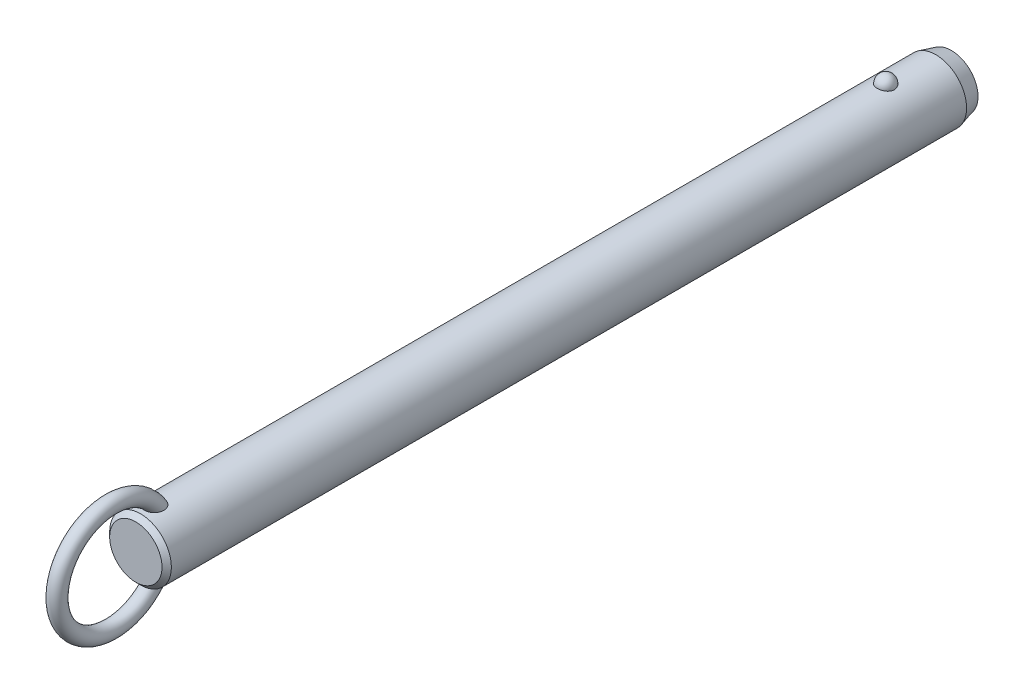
ISO-10303-21;
HEADER;
FILE_DESCRIPTION(('STEP AP214'),'2;1');
FILE_NAME('part.step','',(''),(''),'','','');
FILE_SCHEMA(('AUTOMOTIVE_DESIGN { 1 0 10303 214 1 1 1 1 }'));
ENDSEC;
DATA;
#1=APPLICATION_CONTEXT('core data for automotive mechanical design processes');
#2=APPLICATION_PROTOCOL_DEFINITION('international standard','automotive_design',2000,#1);
#3=PRODUCT_CONTEXT('',#1,'mechanical');
#4=PRODUCT('Part','Part','',(#3));
#5=PRODUCT_RELATED_PRODUCT_CATEGORY('part','',(#4));
#6=PRODUCT_DEFINITION_FORMATION('','',#4);
#7=PRODUCT_DEFINITION_CONTEXT('part definition',#1,'design');
#8=PRODUCT_DEFINITION('design','',#6,#7);
#9=PRODUCT_DEFINITION_SHAPE('','',#8);
#10=(LENGTH_UNIT() NAMED_UNIT(*) SI_UNIT(.MILLI.,.METRE.));
#11=(NAMED_UNIT(*) PLANE_ANGLE_UNIT() SI_UNIT($,.RADIAN.));
#12=(NAMED_UNIT(*) SI_UNIT($,.STERADIAN.) SOLID_ANGLE_UNIT());
#13=UNCERTAINTY_MEASURE_WITH_UNIT(LENGTH_MEASURE(1.E-05),#10,'distance_accuracy_value','');
#14=(GEOMETRIC_REPRESENTATION_CONTEXT(3) GLOBAL_UNCERTAINTY_ASSIGNED_CONTEXT((#13)) GLOBAL_UNIT_ASSIGNED_CONTEXT((#10,
#11,#12)) REPRESENTATION_CONTEXT('',''));
#15=CARTESIAN_POINT('',(0.,0.,0.));
#16=DIRECTION('',(0.,0.,1.));
#17=DIRECTION('',(1.,0.,0.));
#18=AXIS2_PLACEMENT_3D('',#15,#16,#17);
#19=CARTESIAN_POINT('',(0.,0.,180.3));
#20=DIRECTION('',(0.,0.,-1.));
#21=DIRECTION('',(-1.,0.,0.));
#22=AXIS2_PLACEMENT_3D('',#19,#20,#21);
#23=CYLINDRICAL_SURFACE('',#22,7.9);
#24=CARTESIAN_POINT('',(2.1785689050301,7.59367088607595,-2.20000000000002));
#25=CARTESIAN_POINT('',(2.17856679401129,7.59367269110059,-2.07701843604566));
#26=CARTESIAN_POINT('',(2.16853481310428,7.59657145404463,-1.95401006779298));
#27=CARTESIAN_POINT('',(2.12864689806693,7.607843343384,-1.71147811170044));
#28=CARTESIAN_POINT('',(2.09878338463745,7.61621856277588,-1.5919558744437));
#29=CARTESIAN_POINT('',(2.0199931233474,7.63749180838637,-1.35985638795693));
#30=CARTESIAN_POINT('',(1.97107475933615,7.6503878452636,-1.24727610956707));
#31=CARTESIAN_POINT('',(1.85539377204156,7.67926115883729,-1.03213234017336));
#32=CARTESIAN_POINT('',(1.78863158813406,7.69523835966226,-0.929568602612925));
#33=CARTESIAN_POINT('',(1.63856494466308,7.7285848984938,-0.73678633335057));
#34=CARTESIAN_POINT('',(1.55518140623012,7.7459606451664,-0.646630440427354));
#35=CARTESIAN_POINT('',(1.37422937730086,7.78009978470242,-0.481747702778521));
#36=CARTESIAN_POINT('',(1.27666086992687,7.79686317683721,-0.407020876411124));
#37=CARTESIAN_POINT('',(1.07024728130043,7.82786153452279,-0.275278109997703));
#38=CARTESIAN_POINT('',(0.961434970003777,7.84210353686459,-0.218212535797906));
#39=CARTESIAN_POINT('',(0.735351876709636,7.86652194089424,-0.123146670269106));
#40=CARTESIAN_POINT('',(0.618082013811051,7.87669878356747,-0.0851443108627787));
#41=CARTESIAN_POINT('',(0.380637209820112,7.89170521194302,-0.0298158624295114));
#42=CARTESIAN_POINT('',(0.260550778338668,7.89662650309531,-0.0121347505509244));
#43=CARTESIAN_POINT('',(0.0190117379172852,7.90090003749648,0.00324379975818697));
#44=CARTESIAN_POINT('',(-0.102440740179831,7.90025280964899,0.000943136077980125));
#45=CARTESIAN_POINT('',(-0.341452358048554,7.89351056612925,-0.0233955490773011));
#46=CARTESIAN_POINT('',(-0.459042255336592,7.88749257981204,-0.0451545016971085));
#47=CARTESIAN_POINT('',(-0.688796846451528,7.87075812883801,-0.107408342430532));
#48=CARTESIAN_POINT('',(-0.800961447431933,7.86004158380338,-0.14790355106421));
#49=CARTESIAN_POINT('',(-1.01743634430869,7.83497131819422,-0.246799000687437));
#50=CARTESIAN_POINT('',(-1.12169791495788,7.82059709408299,-0.305300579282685));
#51=CARTESIAN_POINT('',(-1.31891765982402,7.78976470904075,-0.43854939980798));
#52=CARTESIAN_POINT('',(-1.41187469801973,7.77330633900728,-0.513298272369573));
#53=CARTESIAN_POINT('',(-1.58577142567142,7.73972434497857,-0.678622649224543));
#54=CARTESIAN_POINT('',(-1.66645140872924,7.72259402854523,-0.769470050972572));
#55=CARTESIAN_POINT('',(-1.81161503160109,7.68983776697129,-0.963538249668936));
#56=CARTESIAN_POINT('',(-1.87609753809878,7.6742119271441,-1.0667599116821));
#57=CARTESIAN_POINT('',(-1.98790138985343,7.6460202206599,-1.28401170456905));
#58=CARTESIAN_POINT('',(-2.03501994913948,7.63349104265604,-1.39815107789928));
#59=CARTESIAN_POINT('',(-2.10986724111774,7.6131449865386,-1.6330178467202));
#60=CARTESIAN_POINT('',(-2.1375965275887,7.60532797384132,-1.75374505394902));
#61=CARTESIAN_POINT('',(-2.17289256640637,7.5953195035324,-1.99782562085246));
#62=CARTESIAN_POINT('',(-2.18054294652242,7.59310471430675,-2.12116592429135));
#63=CARTESIAN_POINT('',(-2.17572919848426,7.59448538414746,-2.36741799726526));
#64=CARTESIAN_POINT('',(-2.1632656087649,7.59808068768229,-2.49032977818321));
#65=CARTESIAN_POINT('',(-2.11865035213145,7.61064035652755,-2.73161015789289));
#66=CARTESIAN_POINT('',(-2.08659579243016,7.61957823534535,-2.84999812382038));
#67=CARTESIAN_POINT('',(-2.00367799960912,7.64179982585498,-3.07955956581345));
#68=CARTESIAN_POINT('',(-1.9528140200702,7.65508371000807,-3.19073275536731));
#69=CARTESIAN_POINT('',(-1.83321113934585,7.68460381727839,-3.40337899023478));
#70=CARTESIAN_POINT('',(-1.76437735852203,7.70085556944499,-3.5047965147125));
#71=CARTESIAN_POINT('',(-1.61069526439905,7.73445734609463,-3.69446912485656));
#72=CARTESIAN_POINT('',(-1.52584634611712,7.75180741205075,-3.78272371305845));
#73=CARTESIAN_POINT('',(-1.34198059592,7.78574608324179,-3.94393987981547));
#74=CARTESIAN_POINT('',(-1.24291308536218,7.80233167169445,-4.01684434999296));
#75=CARTESIAN_POINT('',(-1.03352039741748,7.83281625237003,-4.14489386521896));
#76=CARTESIAN_POINT('',(-0.92319600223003,7.84671543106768,-4.20004014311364));
#77=CARTESIAN_POINT('',(-0.695822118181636,7.87011575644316,-4.29042017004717));
#78=CARTESIAN_POINT('',(-0.578872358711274,7.87966903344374,-4.32589112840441));
#79=CARTESIAN_POINT('',(-0.340410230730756,7.8935652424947,-4.37692226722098));
#80=CARTESIAN_POINT('',(-0.218898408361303,7.89790879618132,-4.39248482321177));
#81=CARTESIAN_POINT('',(0.0228107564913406,7.90087453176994,-4.40314405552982));
#82=CARTESIAN_POINT('',(0.142990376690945,7.89960185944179,-4.39861683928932));
#83=CARTESIAN_POINT('',(0.380829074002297,7.89171262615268,-4.37008293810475));
#84=CARTESIAN_POINT('',(0.498488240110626,7.8850962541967,-4.34607694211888));
#85=CARTESIAN_POINT('',(0.727535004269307,7.86726442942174,-4.27939317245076));
#86=CARTESIAN_POINT('',(0.838944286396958,7.85606616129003,-4.23678512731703));
#87=CARTESIAN_POINT('',(1.05295421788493,7.83025654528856,-4.13408348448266));
#88=CARTESIAN_POINT('',(1.15555431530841,7.81564498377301,-4.07398879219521));
#89=CARTESIAN_POINT('',(1.35076763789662,7.7843022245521,-3.93687432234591));
#90=CARTESIAN_POINT('',(1.4432046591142,7.76754209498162,-3.85961036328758));
#91=CARTESIAN_POINT('',(1.6139111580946,7.73387857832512,-3.69076949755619));
#92=CARTESIAN_POINT('',(1.6921781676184,7.71697516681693,-3.59919010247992));
#93=CARTESIAN_POINT('',(1.83380875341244,7.6845643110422,-3.40247278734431));
#94=CARTESIAN_POINT('',(1.89689280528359,7.66908588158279,-3.29712873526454));
#95=CARTESIAN_POINT('',(2.0047823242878,7.64159441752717,-3.07707931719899));
#96=CARTESIAN_POINT('',(2.0495945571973,7.62958010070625,-2.96237743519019));
#97=CARTESIAN_POINT('',(2.11580183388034,7.61146617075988,-2.74040519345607));
#98=CARTESIAN_POINT('',(2.13929812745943,7.60484503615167,-2.63379846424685));
#99=CARTESIAN_POINT('',(2.17068242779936,7.59594664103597,-2.4181348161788));
#100=CARTESIAN_POINT('',(2.17857077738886,7.59366928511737,-2.30907795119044));
#101=CARTESIAN_POINT('',(2.1785689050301,7.59367088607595,-2.20000000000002));
#102=B_SPLINE_CURVE_WITH_KNOTS('',3,(#24,#25,#26,#27,#28,#29,#30,#31,#32,#33,#34,#35,#36,#37,
#38,#39,#40,#41,#42,#43,#44,#45,#46,#47,#48,#49,#50,#51,#52,#53,#54,#55,#56,#57,#58,#59,#60,#61,
#62,#63,#64,#65,#66,#67,#68,#69,#70,#71,#72,#73,#74,#75,#76,#77,#78,#79,#80,#81,#82,#83,#84,#85,
#86,#87,#88,#89,#90,#91,#92,#93,#94,#95,#96,#97,#98,#99,#100,#101),.UNSPECIFIED.,.T.,.F.,(4,2,2,
2,2,2,2,2,2,2,2,2,2,2,2,2,2,2,2,2,2,2,2,2,2,2,2,2,2,2,2,2,2,2,2,2,2,2,4),(0.,0.368552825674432,
0.737246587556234,1.10577831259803,1.4743009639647,1.8446206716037,2.21494081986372,
2.5842105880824,2.95344028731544,3.31611630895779,3.67875788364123,4.03628044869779,
4.39380913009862,4.75338791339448,5.11300280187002,5.47939989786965,5.8458226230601,
6.21639834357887,6.58696347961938,6.95598276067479,7.32499216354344,7.69218715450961,
8.0593967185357,8.42858578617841,8.79778880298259,9.16834203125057,9.5388695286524,
9.90482699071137,10.2707407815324,10.6298333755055,10.9889132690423,11.3466585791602,
11.7044262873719,12.0676511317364,12.4309391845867,12.8004764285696,13.1698767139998,
13.4967701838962,13.8236564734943),.UNSPECIFIED.);
#103=CARTESIAN_POINT('',(2.1785689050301,7.59367088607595,-2.20000000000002));
#104=VERTEX_POINT('',#103);
#105=EDGE_CURVE('E41',#104,#104,#102,.T.);
#106=ORIENTED_EDGE('',*,*,#105,.T.);
#107=EDGE_LOOP('',(#106));
#108=FACE_BOUND('',#107,.T.);
#109=CARTESIAN_POINT('',(0.,0.,188.62));
#110=DIRECTION('',(0.,0.,1.));
#111=DIRECTION('',(1.,0.,0.));
#112=AXIS2_PLACEMENT_3D('',#109,#110,#111);
#113=CIRCLE('',#112,7.9);
#114=CARTESIAN_POINT('',(7.9,0.,188.62));
#115=VERTEX_POINT('',#114);
#116=EDGE_CURVE('E10',#115,#115,#113,.F.);
#117=ORIENTED_EDGE('',*,*,#116,.T.);
#118=EDGE_LOOP('',(#117));
#119=FACE_BOUND('',#118,.T.);
#120=CARTESIAN_POINT('',(-0.630969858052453,-7.87476203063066,182.512432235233));
#121=CARTESIAN_POINT('',(-0.734180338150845,-7.86648998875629,182.547285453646));
#122=CARTESIAN_POINT('',(-0.834476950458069,-7.85639291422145,182.590816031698));
#123=CARTESIAN_POINT('',(-1.0262035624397,-7.83366343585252,182.694094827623));
#124=CARTESIAN_POINT('',(-1.1176141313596,-7.82102565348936,182.753877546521));
#125=CARTESIAN_POINT('',(-1.28877277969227,-7.79464922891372,182.887839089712));
#126=CARTESIAN_POINT('',(-1.36854014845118,-7.78091246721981,182.961993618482));
#127=CARTESIAN_POINT('',(-1.5146152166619,-7.75380398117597,183.122494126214));
#128=CARTESIAN_POINT('',(-1.58092966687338,-7.74043207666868,183.208833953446));
#129=CARTESIAN_POINT('',(-1.70019064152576,-7.7151252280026,183.392978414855));
#130=CARTESIAN_POINT('',(-1.75284037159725,-7.70322473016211,183.490979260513));
#131=CARTESIAN_POINT('',(-1.84263464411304,-7.68224112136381,183.694102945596));
#132=CARTESIAN_POINT('',(-1.87977299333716,-7.6731591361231,183.799228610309));
#133=CARTESIAN_POINT('',(-1.94152728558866,-7.65777930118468,184.023284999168));
#134=CARTESIAN_POINT('',(-1.96475471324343,-7.65179654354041,184.142616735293));
#135=CARTESIAN_POINT('',(-1.99449499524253,-7.64409642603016,184.38342986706));
#136=CARTESIAN_POINT('',(-2.0010005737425,-7.64238092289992,184.504912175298));
#137=CARTESIAN_POINT('',(-1.99856014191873,-7.64302120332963,184.768340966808));
#138=CARTESIAN_POINT('',(-1.98680021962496,-7.64611845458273,184.91025654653));
#139=CARTESIAN_POINT('',(-1.94457772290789,-7.65696186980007,185.191118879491));
#140=CARTESIAN_POINT('',(-1.91409393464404,-7.66471330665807,185.330062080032));
#141=CARTESIAN_POINT('',(-1.82768670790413,-7.68582947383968,185.631939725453));
#142=CARTESIAN_POINT('',(-1.76772963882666,-7.70003779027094,185.793686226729));
#143=CARTESIAN_POINT('',(-1.65998501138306,-7.72371550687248,186.027695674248));
#144=CARTESIAN_POINT('',(-1.62107967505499,-7.73200670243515,186.104297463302));
#145=CARTESIAN_POINT('',(-1.53727726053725,-7.7491037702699,186.254079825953));
#146=CARTESIAN_POINT('',(-1.49238215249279,-7.75790947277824,186.327261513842));
#147=CARTESIAN_POINT('',(-1.37397050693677,-7.77993338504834,186.50288382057));
#148=CARTESIAN_POINT('',(-1.29690364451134,-7.79328473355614,186.602955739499));
#149=CARTESIAN_POINT('',(-1.12885487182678,-7.81939266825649,186.790714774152));
#150=CARTESIAN_POINT('',(-1.03789926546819,-7.83215032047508,186.878424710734));
#151=CARTESIAN_POINT('',(-0.869532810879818,-7.85231710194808,187.013414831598));
#152=CARTESIAN_POINT('',(-0.795716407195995,-7.86021093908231,187.065076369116));
#153=CARTESIAN_POINT('',(-0.640813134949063,-7.87434920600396,187.156381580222));
#154=CARTESIAN_POINT('',(-0.559737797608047,-7.88059619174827,187.19604389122));
#155=CARTESIAN_POINT('',(-0.406456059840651,-7.88984116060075,187.254300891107));
#156=CARTESIAN_POINT('',(-0.335227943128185,-7.89321892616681,187.275384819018));
#157=CARTESIAN_POINT('',(-0.190193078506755,-7.89804235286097,187.30541418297));
#158=CARTESIAN_POINT('',(-0.116388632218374,-7.89948969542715,187.314370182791));
#159=CARTESIAN_POINT('',(0.0318414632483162,-7.90028409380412,187.319291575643));
#160=CARTESIAN_POINT('',(0.106268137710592,-7.89962640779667,187.315227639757));
#161=CARTESIAN_POINT('',(0.253290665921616,-7.8962818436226,187.294461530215));
#162=CARTESIAN_POINT('',(0.325885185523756,-7.8935935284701,187.277750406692));
#163=CARTESIAN_POINT('',(0.481441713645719,-7.88577340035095,187.228738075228));
#164=CARTESIAN_POINT('',(0.563611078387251,-7.88026321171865,187.194005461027));
#165=CARTESIAN_POINT('',(0.721129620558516,-7.86741729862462,187.111796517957));
#166=CARTESIAN_POINT('',(0.79646633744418,-7.86007832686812,187.064297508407));
#167=CARTESIAN_POINT('',(0.971456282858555,-7.84073285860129,186.936513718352));
#168=CARTESIAN_POINT('',(1.06719686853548,-7.82809461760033,186.851004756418));
#169=CARTESIAN_POINT('',(1.24418921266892,-7.80192439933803,186.666232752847));
#170=CARTESIAN_POINT('',(1.32540832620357,-7.78839049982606,186.566939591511));
#171=CARTESIAN_POINT('',(1.45199971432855,-7.76559693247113,186.389576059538));
#172=CARTESIAN_POINT('',(1.50085649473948,-7.75626094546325,186.313954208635));
#173=CARTESIAN_POINT('',(1.59197749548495,-7.7380727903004,186.158742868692));
#174=CARTESIAN_POINT('',(1.63423919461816,-7.72922080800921,186.079151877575));
#175=CARTESIAN_POINT('',(1.71222612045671,-7.71231959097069,185.916664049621));
#176=CARTESIAN_POINT('',(1.74794516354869,-7.70427111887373,185.833764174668));
#177=CARTESIAN_POINT('',(1.81270113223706,-7.68929240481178,185.665296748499));
#178=CARTESIAN_POINT('',(1.84173789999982,-7.68236218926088,185.579729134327));
#179=CARTESIAN_POINT('',(1.89322698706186,-7.6698375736,185.40528702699));
#180=CARTESIAN_POINT('',(1.91558744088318,-7.66426199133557,185.316383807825));
#181=CARTESIAN_POINT('',(1.95281367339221,-7.65485915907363,185.136969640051));
#182=CARTESIAN_POINT('',(1.96767946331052,-7.65103190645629,185.046458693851));
#183=CARTESIAN_POINT('',(2.0002145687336,-7.64262981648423,184.773732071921));
#184=CARTESIAN_POINT('',(2.00600691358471,-7.6410871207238,184.589709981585));
#185=CARTESIAN_POINT('',(1.98445334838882,-7.64669564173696,184.276501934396));
#186=CARTESIAN_POINT('',(1.96607186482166,-7.65149688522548,184.146618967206));
#187=CARTESIAN_POINT('',(1.90884967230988,-7.66597624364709,183.891632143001));
#188=CARTESIAN_POINT('',(1.87002101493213,-7.67565148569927,183.766525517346));
#189=CARTESIAN_POINT('',(1.77063986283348,-7.69918471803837,183.52454013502));
#190=CARTESIAN_POINT('',(1.70993724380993,-7.71307150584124,183.407725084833));
#191=CARTESIAN_POINT('',(1.56733070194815,-7.74330306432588,183.188144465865));
#192=CARTESIAN_POINT('',(1.48543692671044,-7.75964665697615,183.085372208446));
#193=CARTESIAN_POINT('',(1.31346177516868,-7.79047523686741,182.909380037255));
#194=CARTESIAN_POINT('',(1.22547278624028,-7.80495298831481,182.834106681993));
#195=CARTESIAN_POINT('',(1.03724352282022,-7.83218597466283,182.700486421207));
#196=CARTESIAN_POINT('',(0.93700840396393,-7.84494192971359,182.642132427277));
#197=CARTESIAN_POINT('',(0.733599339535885,-7.86649045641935,182.547027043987));
#198=CARTESIAN_POINT('',(0.630941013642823,-7.87547134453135,182.509210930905));
#199=CARTESIAN_POINT('',(0.420465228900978,-7.88950708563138,182.451116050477));
#200=CARTESIAN_POINT('',(0.312645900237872,-7.89456050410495,182.43084369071));
#201=CARTESIAN_POINT('',(0.096086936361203,-7.9001518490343,182.408455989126));
#202=CARTESIAN_POINT('',(-0.0126341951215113,-7.90073226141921,182.406169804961));
#203=CARTESIAN_POINT('',(-0.228766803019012,-7.89742350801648,182.419367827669));
#204=CARTESIAN_POINT('',(-0.336180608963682,-7.89354403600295,182.434813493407));
#205=CARTESIAN_POINT('',(-0.473410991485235,-7.88586871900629,182.466217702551));
#206=CARTESIAN_POINT('',(-0.50525779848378,-7.88388984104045,182.474354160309));
#207=CARTESIAN_POINT('',(-0.56848128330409,-7.87958326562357,182.492208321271));
#208=CARTESIAN_POINT('',(-0.59985795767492,-7.87725556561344,182.501926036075));
#209=CARTESIAN_POINT('',(-0.630969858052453,-7.87476203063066,182.512432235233));
#210=B_SPLINE_CURVE_WITH_KNOTS('',3,(#120,#121,#122,#123,#124,#125,#126,#127,#128,#129,#130,
#131,#132,#133,#134,#135,#136,#137,#138,#139,#140,#141,#142,#143,#144,#145,#146,#147,#148,#149,
#150,#151,#152,#153,#154,#155,#156,#157,#158,#159,#160,#161,#162,#163,#164,#165,#166,#167,#168,
#169,#170,#171,#172,#173,#174,#175,#176,#177,#178,#179,#180,#181,#182,#183,#184,#185,#186,#187,
#188,#189,#190,#191,#192,#193,#194,#195,#196,#197,#198,#199,#200,#201,#202,#203,#204,#205,#206,
#207,#208,#209),.UNSPECIFIED.,.T.,.F.,(4,2,2,2,2,2,2,2,2,2,2,2,2,2,2,2,2,2,2,2,2,2,2,2,2,2,2,2,
2,2,2,2,2,2,2,2,2,2,2,2,2,2,2,2,4),(0.,0.327622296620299,0.655945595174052,0.983718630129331,
1.31132677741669,1.6455465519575,1.97989964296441,2.34365728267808,2.70757317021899,
3.13333684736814,3.55958380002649,4.07655306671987,4.33527897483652,4.59391999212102,
4.97382437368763,5.353017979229,5.62348245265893,5.89352465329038,6.11565959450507,
6.33760092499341,6.56004255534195,6.78264174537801,7.04930844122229,7.31645206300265,
7.70130871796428,8.08701995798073,8.35824509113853,8.62957365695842,8.9011573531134,
9.17274746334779,9.44791855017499,9.72308922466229,10.2715298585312,10.6638393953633,
11.0559179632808,11.4507403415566,11.8453740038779,12.1936425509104,12.5417649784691,
12.8695063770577,13.1973674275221,13.5221104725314,13.8461490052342,13.9449071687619,
14.0436660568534),.UNSPECIFIED.);
#211=CARTESIAN_POINT('',(-0.630969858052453,-7.87476203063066,182.512432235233));
#212=VERTEX_POINT('',#211);
#213=EDGE_CURVE('E60',#212,#212,#210,.T.);
#214=ORIENTED_EDGE('',*,*,#213,.T.);
#215=EDGE_LOOP('',(#214));
#216=FACE_BOUND('',#215,.T.);
#217=CARTESIAN_POINT('',(-0.630969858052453,7.87476203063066,182.512432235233));
#218=CARTESIAN_POINT('',(-0.528918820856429,7.88293636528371,182.477979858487));
#219=CARTESIAN_POINT('',(-0.423745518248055,7.88934810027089,182.451915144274));
#220=CARTESIAN_POINT('',(-0.210236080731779,7.8979273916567,182.417282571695));
#221=CARTESIAN_POINT('',(-0.10189380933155,7.90008607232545,182.408751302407));
#222=CARTESIAN_POINT('',(0.114660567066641,7.89990877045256,182.409457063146));
#223=CARTESIAN_POINT('',(0.222872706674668,7.89757640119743,182.41867980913));
#224=CARTESIAN_POINT('',(0.436107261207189,7.88867538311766,182.454652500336));
#225=CARTESIAN_POINT('',(0.541131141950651,7.8821087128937,182.48139425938));
#226=CARTESIAN_POINT('',(0.745085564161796,7.86545130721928,182.551756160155));
#227=CARTESIAN_POINT('',(0.844015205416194,7.85536005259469,182.595378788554));
#228=CARTESIAN_POINT('',(1.03299167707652,7.83275153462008,182.698379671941));
#229=CARTESIAN_POINT('',(1.12303841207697,7.8202342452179,182.757758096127));
#230=CARTESIAN_POINT('',(1.29214734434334,7.79408219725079,182.890864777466));
#231=CARTESIAN_POINT('',(1.37116907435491,7.78044359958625,182.964643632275));
#232=CARTESIAN_POINT('',(1.51597677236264,7.75353170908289,183.124235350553));
#233=CARTESIAN_POINT('',(1.58176261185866,7.74025841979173,183.210048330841));
#234=CARTESIAN_POINT('',(1.70057386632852,7.71504069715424,183.393644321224));
#235=CARTESIAN_POINT('',(1.75320073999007,7.7031425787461,183.491690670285));
#236=CARTESIAN_POINT('',(1.8429376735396,7.68216822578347,183.694893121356));
#237=CARTESIAN_POINT('',(1.88004278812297,7.67309289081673,183.800051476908));
#238=CARTESIAN_POINT('',(1.9417232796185,7.6577294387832,184.024167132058));
#239=CARTESIAN_POINT('',(1.96491037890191,7.65175648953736,184.143524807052));
#240=CARTESIAN_POINT('',(1.9945689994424,7.64407702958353,184.384384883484));
#241=CARTESIAN_POINT('',(2.00103304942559,7.64237242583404,184.50588821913));
#242=CARTESIAN_POINT('',(1.99850166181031,7.64303650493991,184.769368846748));
#243=CARTESIAN_POINT('',(1.98669038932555,7.64614714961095,184.911314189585));
#244=CARTESIAN_POINT('',(1.94436120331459,7.6570170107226,185.192228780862));
#245=CARTESIAN_POINT('',(1.91382203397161,7.66478150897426,185.331194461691));
#246=CARTESIAN_POINT('',(1.82728754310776,7.68592483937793,185.633111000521));
#247=CARTESIAN_POINT('',(1.76725778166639,7.7001468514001,185.794872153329));
#248=CARTESIAN_POINT('',(1.65939700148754,7.72384204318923,186.028891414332));
#249=CARTESIAN_POINT('',(1.62045187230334,7.73213852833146,186.105494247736));
#250=CARTESIAN_POINT('',(1.53656684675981,7.74924489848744,186.255273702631));
#251=CARTESIAN_POINT('',(1.49162892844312,7.75805461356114,186.328451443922));
#252=CARTESIAN_POINT('',(1.37317698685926,7.78007342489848,186.503952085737));
#253=CARTESIAN_POINT('',(1.29612360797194,7.79341423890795,186.603911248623));
#254=CARTESIAN_POINT('',(1.12812043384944,7.81949839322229,186.79145083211));
#255=CARTESIAN_POINT('',(1.03719688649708,7.83224280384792,186.879054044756));
#256=CARTESIAN_POINT('',(0.868871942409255,7.85239026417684,187.01389715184));
#257=CARTESIAN_POINT('',(0.795056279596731,7.86027769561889,187.065511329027));
#258=CARTESIAN_POINT('',(0.640160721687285,7.87440222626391,187.156720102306));
#259=CARTESIAN_POINT('',(0.559092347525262,7.88064188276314,187.196333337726));
#260=CARTESIAN_POINT('',(0.405820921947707,7.8898738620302,187.254505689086));
#261=CARTESIAN_POINT('',(0.334594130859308,7.89324577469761,187.275552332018));
#262=CARTESIAN_POINT('',(0.189568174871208,7.89805733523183,187.305507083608));
#263=CARTESIAN_POINT('',(0.115771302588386,7.89949866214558,187.314425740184));
#264=CARTESIAN_POINT('',(-0.0324359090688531,7.90028156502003,187.31927589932));
#265=CARTESIAN_POINT('',(-0.106847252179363,7.89961843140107,187.315178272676));
#266=CARTESIAN_POINT('',(-0.253834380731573,7.8962642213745,187.294351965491));
#267=CARTESIAN_POINT('',(-0.326408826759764,7.89357170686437,187.277614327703));
#268=CARTESIAN_POINT('',(-0.481962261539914,7.88574179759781,187.228539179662));
#269=CARTESIAN_POINT('',(-0.564145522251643,7.88022507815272,187.193763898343));
#270=CARTESIAN_POINT('',(-0.721685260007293,7.86736646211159,187.111468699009));
#271=CARTESIAN_POINT('',(-0.797029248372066,7.8600213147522,187.063926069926));
#272=CARTESIAN_POINT('',(-0.9720442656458,7.84066026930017,186.936026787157));
#273=CARTESIAN_POINT('',(-1.06779803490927,7.82801274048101,186.850443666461));
#274=CARTESIAN_POINT('',(-1.2448053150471,7.80182621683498,186.665522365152));
#275=CARTESIAN_POINT('',(-1.32602618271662,7.78828530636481,186.566154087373));
#276=CARTESIAN_POINT('',(-1.45259834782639,7.76548487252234,186.388680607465));
#277=CARTESIAN_POINT('',(-1.50143856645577,7.75614818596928,186.313025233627));
#278=CARTESIAN_POINT('',(-1.59252410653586,7.73796020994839,186.157748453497));
#279=CARTESIAN_POINT('',(-1.63476690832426,7.72910910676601,186.078125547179));
#280=CARTESIAN_POINT('',(-1.71271318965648,7.71221133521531,185.915575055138));
#281=CARTESIAN_POINT('',(-1.74841047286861,7.70416543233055,185.832644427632));
#282=CARTESIAN_POINT('',(-1.81311929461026,7.6891937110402,185.664116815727));
#283=CARTESIAN_POINT('',(-1.84213067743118,7.68226791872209,185.578519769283));
#284=CARTESIAN_POINT('',(-1.89356259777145,7.66975461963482,185.404025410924));
#285=CARTESIAN_POINT('',(-1.91589165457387,7.66418586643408,185.315099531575));
#286=CARTESIAN_POINT('',(-1.9530507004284,7.65479859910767,185.135642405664));
#287=CARTESIAN_POINT('',(-1.96788069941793,7.65098008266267,185.045111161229));
#288=CARTESIAN_POINT('',(-2.00030078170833,7.64260704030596,184.772327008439));
#289=CARTESIAN_POINT('',(-2.00600576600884,7.64108760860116,184.588271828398));
#290=CARTESIAN_POINT('',(-1.9842848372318,7.64673945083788,184.275080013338));
#291=CARTESIAN_POINT('',(-1.96583698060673,7.65155751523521,184.145240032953));
#292=CARTESIAN_POINT('',(-1.90848948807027,7.66606613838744,183.890361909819));
#293=CARTESIAN_POINT('',(-1.86960376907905,7.67575338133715,183.765320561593));
#294=CARTESIAN_POINT('',(-1.77013421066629,7.6993013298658,183.523500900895));
#295=CARTESIAN_POINT('',(-1.70940488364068,7.71318991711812,183.406784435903));
#296=CARTESIAN_POINT('',(-1.56672953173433,7.74342495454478,183.187340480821));
#297=CARTESIAN_POINT('',(-1.48478316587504,7.75977144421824,183.08461321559));
#298=CARTESIAN_POINT('',(-1.31266325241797,7.79061163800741,182.908643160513));
#299=CARTESIAN_POINT('',(-1.22456383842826,7.80509908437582,182.833358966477));
#300=CARTESIAN_POINT('',(-1.03622400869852,7.83231881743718,182.699865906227));
#301=CARTESIAN_POINT('',(-0.936015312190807,7.84505551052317,182.641613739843));
#302=CARTESIAN_POINT('',(-0.798824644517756,7.85957802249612,182.577540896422));
#303=CARTESIAN_POINT('',(-0.765787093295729,7.86286821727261,182.563224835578));
#304=CARTESIAN_POINT('',(-0.698939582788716,7.86909211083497,182.536436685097));
#305=CARTESIAN_POINT('',(-0.66512963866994,7.8720258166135,182.523964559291));
#306=CARTESIAN_POINT('',(-0.630969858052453,7.87476203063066,182.512432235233));
#307=B_SPLINE_CURVE_WITH_KNOTS('',3,(#217,#218,#219,#220,#221,#222,#223,#224,#225,#226,#227,
#228,#229,#230,#231,#232,#233,#234,#235,#236,#237,#238,#239,#240,#241,#242,#243,#244,#245,#246,
#247,#248,#249,#250,#251,#252,#253,#254,#255,#256,#257,#258,#259,#260,#261,#262,#263,#264,#265,
#266,#267,#268,#269,#270,#271,#272,#273,#274,#275,#276,#277,#278,#279,#280,#281,#282,#283,#284,
#285,#286,#287,#288,#289,#290,#291,#292,#293,#294,#295,#296,#297,#298,#299,#300,#301,#302,#303,
#304,#305,#306),.UNSPECIFIED.,.T.,.F.,(4,2,2,2,2,2,2,2,2,2,2,2,2,2,2,2,2,2,2,2,2,2,2,2,2,2,2,2,
2,2,2,2,2,2,2,2,2,2,2,2,2,2,2,2,4),(0.,0.323920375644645,0.648516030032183,0.972850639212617,
1.29703380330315,1.62126473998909,1.94549915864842,2.27089401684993,2.5962920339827,
2.93059633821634,3.26500707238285,3.6288164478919,3.99278833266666,4.41865421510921,
4.84500434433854,5.36209210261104,5.62087589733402,5.87957448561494,6.25918598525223,
6.63808782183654,6.90846748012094,7.17842501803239,7.40052350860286,7.6224287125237,
7.84483086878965,8.06739077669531,8.33414615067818,8.60137921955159,8.98641454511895,
9.37230415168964,9.64358673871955,9.91497268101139,10.1866142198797,10.4582620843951,
10.7334745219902,11.008686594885,11.5572126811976,11.9494246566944,12.3413699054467,
12.7359755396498,13.1305875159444,13.4791770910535,13.82687259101,13.9353013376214,
14.0437279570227),.UNSPECIFIED.);
#308=CARTESIAN_POINT('',(-0.630969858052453,7.87476203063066,182.512432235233));
#309=VERTEX_POINT('',#308);
#310=EDGE_CURVE('E68',#309,#309,#307,.T.);
#311=ORIENTED_EDGE('',*,*,#310,.T.);
#312=EDGE_LOOP('',(#311));
#313=FACE_BOUND('',#312,.T.);
#314=CARTESIAN_POINT('',(0.,0.,-15.));
#315=DIRECTION('',(0.,0.,-1.));
#316=DIRECTION('',(-1.,0.,0.));
#317=AXIS2_PLACEMENT_3D('',#314,#315,#316);
#318=CIRCLE('',#317,7.9);
#319=CARTESIAN_POINT('',(-7.9,0.,-15.));
#320=VERTEX_POINT('',#319);
#321=EDGE_CURVE('E57',#320,#320,#318,.F.);
#322=ORIENTED_EDGE('',*,*,#321,.T.);
#323=EDGE_LOOP('',(#322));
#324=FACE_BOUND('',#323,.T.);
#325=ADVANCED_FACE('F37',(#108,#119,#216,#313,#324),#23,.T.);
#326=CARTESIAN_POINT('',(0.,0.,-19.));
#327=DIRECTION('',(0.,0.,-1.));
#328=DIRECTION('',(-1.,0.,0.));
#329=AXIS2_PLACEMENT_3D('',#326,#327,#328);
#330=PLANE('',#329);
#331=CARTESIAN_POINT('',(0.,0.,-19.));
#332=DIRECTION('',(0.,0.,-1.));
#333=DIRECTION('',(-1.,0.,0.));
#334=AXIS2_PLACEMENT_3D('',#331,#332,#333);
#335=CIRCLE('',#334,6.82820323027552);
#336=CARTESIAN_POINT('',(-6.82820323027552,0.,-19.));
#337=VERTEX_POINT('',#336);
#338=EDGE_CURVE('E67',#337,#337,#335,.T.);
#339=ORIENTED_EDGE('',*,*,#338,.T.);
#340=EDGE_LOOP('',(#339));
#341=FACE_BOUND('',#340,.T.);
#342=ADVANCED_FACE('F86',(#341),#330,.T.);
#343=CARTESIAN_POINT('',(0.,0.,-19.));
#344=DIRECTION('',(0.,0.,1.));
#345=DIRECTION('',(1.,0.,0.));
#346=AXIS2_PLACEMENT_3D('',#343,#344,#345);
#347=CONICAL_SURFACE('',#346,6.82820323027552,0.261799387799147);
#348=ORIENTED_EDGE('',*,*,#321,.F.);
#349=EDGE_LOOP('',(#348));
#350=FACE_BOUND('',#349,.T.);
#351=ORIENTED_EDGE('',*,*,#338,.F.);
#352=EDGE_LOOP('',(#351));
#353=FACE_BOUND('',#352,.T.);
#354=ADVANCED_FACE('F84',(#350,#353),#347,.T.);
#355=CARTESIAN_POINT('',(0.,0.,189.82));
#356=DIRECTION('',(0.,0.,1.));
#357=DIRECTION('',(1.,0.,0.));
#358=AXIS2_PLACEMENT_3D('',#355,#356,#357);
#359=PLANE('',#358);
#360=CARTESIAN_POINT('',(0.,0.,189.82));
#361=DIRECTION('',(0.,0.,1.));
#362=DIRECTION('',(1.,0.,0.));
#363=AXIS2_PLACEMENT_3D('',#360,#361,#362);
#364=CIRCLE('',#363,6.69999999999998);
#365=CARTESIAN_POINT('',(6.69999999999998,0.,189.82));
#366=VERTEX_POINT('',#365);
#367=EDGE_CURVE('E50',#366,#366,#364,.T.);
#368=ORIENTED_EDGE('',*,*,#367,.T.);
#369=EDGE_LOOP('',(#368));
#370=FACE_BOUND('',#369,.T.);
#371=ADVANCED_FACE('F78',(#370),#359,.T.);
#372=CARTESIAN_POINT('',(0.,0.,196.15));
#373=DIRECTION('',(1.,0.,0.));
#374=DIRECTION('',(0.,0.,-1.));
#375=AXIS2_PLACEMENT_3D('',#372,#373,#374);
#376=TOROIDAL_SURFACE('',#375,13.85,2.);
#377=ORIENTED_EDGE('',*,*,#310,.F.);
#378=EDGE_LOOP('',(#377));
#379=FACE_BOUND('',#378,.T.);
#380=ORIENTED_EDGE('',*,*,#213,.F.);
#381=EDGE_LOOP('',(#380));
#382=FACE_BOUND('',#381,.T.);
#383=ADVANCED_FACE('F74',(#379,#382),#376,.T.);
#384=CARTESIAN_POINT('',(0.,0.,189.82));
#385=DIRECTION('',(0.,0.,-1.));
#386=DIRECTION('',(-1.,0.,0.));
#387=AXIS2_PLACEMENT_3D('',#384,#385,#386);
#388=CONICAL_SURFACE('',#387,6.69999999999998,0.785398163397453);
#389=ORIENTED_EDGE('',*,*,#116,.F.);
#390=EDGE_LOOP('',(#389));
#391=FACE_BOUND('',#390,.T.);
#392=ORIENTED_EDGE('',*,*,#367,.F.);
#393=EDGE_LOOP('',(#392));
#394=FACE_BOUND('',#393,.T.);
#395=ADVANCED_FACE('F39',(#391,#394),#388,.T.);
#396=CARTESIAN_POINT('',(0.,7.9,-2.20000000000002));
#397=DIRECTION('',(0.,1.,0.));
#398=DIRECTION('',(0.,0.,1.));
#399=AXIS2_PLACEMENT_3D('',#396,#397,#398);
#400=SPHERICAL_SURFACE('',#399,2.2);
#401=ORIENTED_EDGE('',*,*,#105,.F.);
#402=EDGE_LOOP('',(#401));
#403=FACE_BOUND('',#402,.T.);
#404=ADVANCED_FACE('F80',(#403),#400,.T.);
#405=CLOSED_SHELL('',(#325,#342,#354,#371,#383,#395,#404));
#406=MANIFOLD_SOLID_BREP('B2',#405);
#407=ADVANCED_BREP_SHAPE_REPRESENTATION('',(#18,#406),#14);
#408=SHAPE_DEFINITION_REPRESENTATION(#9,#407);
ENDSEC;
END-ISO-10303-21;
